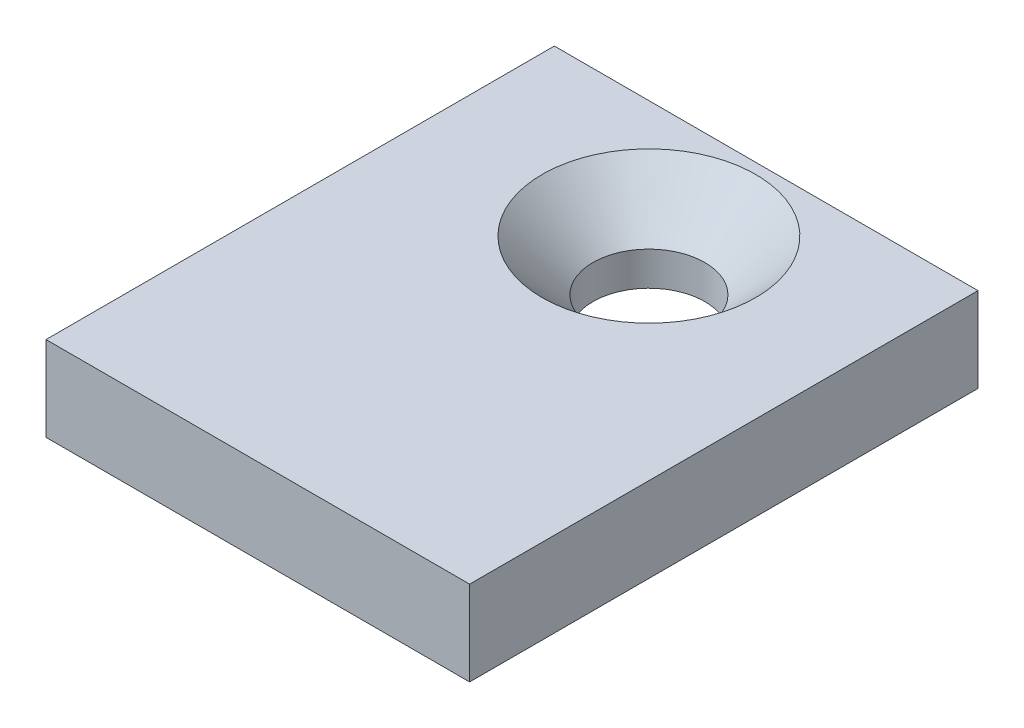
ISO-10303-21;
HEADER;
FILE_DESCRIPTION(('STEP AP214'),'2;1');
FILE_NAME('part.step','',(''),(''),'','','');
FILE_SCHEMA(('AUTOMOTIVE_DESIGN { 1 0 10303 214 1 1 1 1 }'));
ENDSEC;
DATA;
#1=APPLICATION_CONTEXT('core data for automotive mechanical design processes');
#2=APPLICATION_PROTOCOL_DEFINITION('international standard','automotive_design',2000,#1);
#3=PRODUCT_CONTEXT('',#1,'mechanical');
#4=PRODUCT('Part','Part','',(#3));
#5=PRODUCT_RELATED_PRODUCT_CATEGORY('part','',(#4));
#6=PRODUCT_DEFINITION_FORMATION('','',#4);
#7=PRODUCT_DEFINITION_CONTEXT('part definition',#1,'design');
#8=PRODUCT_DEFINITION('design','',#6,#7);
#9=PRODUCT_DEFINITION_SHAPE('','',#8);
#10=(LENGTH_UNIT() NAMED_UNIT(*) SI_UNIT(.MILLI.,.METRE.));
#11=(NAMED_UNIT(*) PLANE_ANGLE_UNIT() SI_UNIT($,.RADIAN.));
#12=(NAMED_UNIT(*) SI_UNIT($,.STERADIAN.) SOLID_ANGLE_UNIT());
#13=UNCERTAINTY_MEASURE_WITH_UNIT(LENGTH_MEASURE(1.E-05),#10,'distance_accuracy_value','');
#14=(GEOMETRIC_REPRESENTATION_CONTEXT(3) GLOBAL_UNCERTAINTY_ASSIGNED_CONTEXT((#13)) GLOBAL_UNIT_ASSIGNED_CONTEXT((#10,
#11,#12)) REPRESENTATION_CONTEXT('',''));
#15=CARTESIAN_POINT('',(0.,0.,0.));
#16=DIRECTION('',(0.,0.,1.));
#17=DIRECTION('',(1.,0.,0.));
#18=AXIS2_PLACEMENT_3D('',#15,#16,#17);
#19=CARTESIAN_POINT('',(5.20806371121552,4.80713746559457,30.));
#20=DIRECTION('',(1.,0.,0.));
#21=DIRECTION('',(0.,0.,-1.));
#22=AXIS2_PLACEMENT_3D('',#19,#20,#21);
#23=PLANE('',#22);
#24=DIRECTION('',(0.,-1.,0.));
#25=VECTOR('',#24,1.);
#26=CARTESIAN_POINT('',(5.20806371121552,4.80713746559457,0.));
#27=LINE('',#26,#25);
#28=CARTESIAN_POINT('',(5.20806371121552,4.80713746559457,0.));
#29=VERTEX_POINT('',#28);
#30=CARTESIAN_POINT('',(5.20806371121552,-0.192862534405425,0.));
#31=VERTEX_POINT('',#30);
#32=EDGE_CURVE('E104',#29,#31,#27,.T.);
#33=ORIENTED_EDGE('',*,*,#32,.T.);
#34=DIRECTION('',(0.,0.,-1.));
#35=VECTOR('',#34,1.);
#36=CARTESIAN_POINT('',(5.20806371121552,-0.192862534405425,30.));
#37=LINE('',#36,#35);
#38=CARTESIAN_POINT('',(5.20806371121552,-0.192862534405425,30.));
#39=VERTEX_POINT('',#38);
#40=EDGE_CURVE('E11',#39,#31,#37,.T.);
#41=ORIENTED_EDGE('',*,*,#40,.F.);
#42=DIRECTION('',(0.,-1.,0.));
#43=VECTOR('',#42,1.);
#44=CARTESIAN_POINT('',(5.20806371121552,4.80713746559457,30.));
#45=LINE('',#44,#43);
#46=CARTESIAN_POINT('',(5.20806371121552,4.80713746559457,30.));
#47=VERTEX_POINT('',#46);
#48=EDGE_CURVE('E92',#47,#39,#45,.T.);
#49=ORIENTED_EDGE('',*,*,#48,.F.);
#50=DIRECTION('',(0.,0.,-1.));
#51=VECTOR('',#50,1.);
#52=CARTESIAN_POINT('',(5.20806371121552,4.80713746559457,30.));
#53=LINE('',#52,#51);
#54=EDGE_CURVE('E100',#47,#29,#53,.T.);
#55=ORIENTED_EDGE('',*,*,#54,.T.);
#56=EDGE_LOOP('',(#33,#41,#49,#55));
#57=FACE_BOUND('',#56,.T.);
#58=ADVANCED_FACE('F41',(#57),#23,.F.);
#59=CARTESIAN_POINT('',(5.20806371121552,-0.192862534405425,30.));
#60=DIRECTION('',(0.,1.,0.));
#61=DIRECTION('',(0.,0.,1.));
#62=AXIS2_PLACEMENT_3D('',#59,#60,#61);
#63=PLANE('',#62);
#64=CARTESIAN_POINT('',(17.7080637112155,-0.192862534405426,6.92026996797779));
#65=DIRECTION('',(0.,1.,0.));
#66=DIRECTION('',(0.,0.,1.));
#67=AXIS2_PLACEMENT_3D('',#64,#65,#66);
#68=CIRCLE('',#67,3.3);
#69=CARTESIAN_POINT('',(17.7080637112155,-0.192862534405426,10.2202699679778));
#70=VERTEX_POINT('',#69);
#71=EDGE_CURVE('E107',#70,#70,#68,.T.);
#72=ORIENTED_EDGE('',*,*,#71,.T.);
#73=EDGE_LOOP('',(#72));
#74=FACE_BOUND('',#73,.T.);
#75=DIRECTION('',(1.,0.,0.));
#76=VECTOR('',#75,1.);
#77=CARTESIAN_POINT('',(5.20806371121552,-0.192862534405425,0.));
#78=LINE('',#77,#76);
#79=CARTESIAN_POINT('',(30.2080637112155,-0.192862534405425,0.));
#80=VERTEX_POINT('',#79);
#81=EDGE_CURVE('E96',#31,#80,#78,.T.);
#82=ORIENTED_EDGE('',*,*,#81,.T.);
#83=DIRECTION('',(0.,0.,-1.));
#84=VECTOR('',#83,1.);
#85=CARTESIAN_POINT('',(30.2080637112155,-0.192862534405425,30.));
#86=LINE('',#85,#84);
#87=CARTESIAN_POINT('',(30.2080637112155,-0.192862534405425,30.));
#88=VERTEX_POINT('',#87);
#89=EDGE_CURVE('E49',#88,#80,#86,.T.);
#90=ORIENTED_EDGE('',*,*,#89,.F.);
#91=DIRECTION('',(1.,0.,0.));
#92=VECTOR('',#91,1.);
#93=CARTESIAN_POINT('',(5.20806371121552,-0.192862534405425,30.));
#94=LINE('',#93,#92);
#95=EDGE_CURVE('E87',#39,#88,#94,.T.);
#96=ORIENTED_EDGE('',*,*,#95,.F.);
#97=ORIENTED_EDGE('',*,*,#40,.T.);
#98=EDGE_LOOP('',(#82,#90,#96,#97));
#99=FACE_BOUND('',#98,.T.);
#100=ADVANCED_FACE('F95',(#74,#99),#63,.F.);
#101=CARTESIAN_POINT('',(30.2080637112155,-0.192862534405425,30.));
#102=DIRECTION('',(-1.,0.,0.));
#103=DIRECTION('',(0.,0.,1.));
#104=AXIS2_PLACEMENT_3D('',#101,#102,#103);
#105=PLANE('',#104);
#106=DIRECTION('',(0.,1.,0.));
#107=VECTOR('',#106,1.);
#108=CARTESIAN_POINT('',(30.2080637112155,-0.192862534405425,0.));
#109=LINE('',#108,#107);
#110=CARTESIAN_POINT('',(30.2080637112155,4.80713746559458,0.));
#111=VERTEX_POINT('',#110);
#112=EDGE_CURVE('E74',#80,#111,#109,.T.);
#113=ORIENTED_EDGE('',*,*,#112,.T.);
#114=DIRECTION('',(0.,0.,-1.));
#115=VECTOR('',#114,1.);
#116=CARTESIAN_POINT('',(30.2080637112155,4.80713746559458,30.));
#117=LINE('',#116,#115);
#118=CARTESIAN_POINT('',(30.2080637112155,4.80713746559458,30.));
#119=VERTEX_POINT('',#118);
#120=EDGE_CURVE('E97',#119,#111,#117,.T.);
#121=ORIENTED_EDGE('',*,*,#120,.F.);
#122=DIRECTION('',(0.,1.,0.));
#123=VECTOR('',#122,1.);
#124=CARTESIAN_POINT('',(30.2080637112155,-0.192862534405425,30.));
#125=LINE('',#124,#123);
#126=EDGE_CURVE('E90',#88,#119,#125,.T.);
#127=ORIENTED_EDGE('',*,*,#126,.F.);
#128=ORIENTED_EDGE('',*,*,#89,.T.);
#129=EDGE_LOOP('',(#113,#121,#127,#128));
#130=FACE_BOUND('',#129,.T.);
#131=ADVANCED_FACE('F98',(#130),#105,.F.);
#132=CARTESIAN_POINT('',(30.2080637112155,4.80713746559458,30.));
#133=DIRECTION('',(0.,-1.,0.));
#134=DIRECTION('',(1.,0.,0.));
#135=AXIS2_PLACEMENT_3D('',#132,#133,#134);
#136=PLANE('',#135);
#137=CARTESIAN_POINT('',(17.7080637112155,4.80713746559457,6.92026996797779));
#138=DIRECTION('',(0.,1.,0.));
#139=DIRECTION('',(0.,0.,1.));
#140=AXIS2_PLACEMENT_3D('',#137,#138,#139);
#141=CIRCLE('',#140,6.3);
#142=CARTESIAN_POINT('',(17.7080637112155,4.80713746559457,13.2202699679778));
#143=VERTEX_POINT('',#142);
#144=EDGE_CURVE('E123',#143,#143,#141,.T.);
#145=ORIENTED_EDGE('',*,*,#144,.F.);
#146=EDGE_LOOP('',(#145));
#147=FACE_BOUND('',#146,.T.);
#148=DIRECTION('',(-1.,0.,0.));
#149=VECTOR('',#148,1.);
#150=CARTESIAN_POINT('',(30.2080637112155,4.80713746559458,0.));
#151=LINE('',#150,#149);
#152=EDGE_CURVE('E80',#111,#29,#151,.T.);
#153=ORIENTED_EDGE('',*,*,#152,.T.);
#154=ORIENTED_EDGE('',*,*,#54,.F.);
#155=DIRECTION('',(-1.,0.,0.));
#156=VECTOR('',#155,1.);
#157=CARTESIAN_POINT('',(30.2080637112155,4.80713746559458,30.));
#158=LINE('',#157,#156);
#159=EDGE_CURVE('E57',#119,#47,#158,.T.);
#160=ORIENTED_EDGE('',*,*,#159,.F.);
#161=ORIENTED_EDGE('',*,*,#120,.T.);
#162=EDGE_LOOP('',(#153,#154,#160,#161));
#163=FACE_BOUND('',#162,.T.);
#164=ADVANCED_FACE('F112',(#147,#163),#136,.F.);
#165=CARTESIAN_POINT('',(0.,0.,30.));
#166=DIRECTION('',(0.,0.,1.));
#167=DIRECTION('',(1.,0.,0.));
#168=AXIS2_PLACEMENT_3D('',#165,#166,#167);
#169=PLANE('',#168);
#170=ORIENTED_EDGE('',*,*,#48,.T.);
#171=ORIENTED_EDGE('',*,*,#95,.T.);
#172=ORIENTED_EDGE('',*,*,#126,.T.);
#173=ORIENTED_EDGE('',*,*,#159,.T.);
#174=EDGE_LOOP('',(#170,#171,#172,#173));
#175=FACE_BOUND('',#174,.T.);
#176=ADVANCED_FACE('F88',(#175),#169,.T.);
#177=CARTESIAN_POINT('',(0.,0.,0.));
#178=DIRECTION('',(0.,0.,1.));
#179=DIRECTION('',(1.,0.,0.));
#180=AXIS2_PLACEMENT_3D('',#177,#178,#179);
#181=PLANE('',#180);
#182=ORIENTED_EDGE('',*,*,#32,.F.);
#183=ORIENTED_EDGE('',*,*,#152,.F.);
#184=ORIENTED_EDGE('',*,*,#112,.F.);
#185=ORIENTED_EDGE('',*,*,#81,.F.);
#186=EDGE_LOOP('',(#182,#183,#184,#185));
#187=FACE_BOUND('',#186,.T.);
#188=ADVANCED_FACE('F115',(#187),#181,.F.);
#189=CARTESIAN_POINT('',(17.7080637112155,4.80713746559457,6.92026996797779));
#190=DIRECTION('',(0.,1.,0.));
#191=DIRECTION('',(0.,0.,1.));
#192=AXIS2_PLACEMENT_3D('',#189,#190,#191);
#193=CYLINDRICAL_SURFACE('',#192,3.3);
#194=ORIENTED_EDGE('',*,*,#71,.F.);
#195=EDGE_LOOP('',(#194));
#196=FACE_BOUND('',#195,.T.);
#197=CARTESIAN_POINT('',(17.7080637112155,1.80713746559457,6.92026996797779));
#198=DIRECTION('',(0.,1.,0.));
#199=DIRECTION('',(0.,0.,1.));
#200=AXIS2_PLACEMENT_3D('',#197,#198,#199);
#201=CIRCLE('',#200,3.3);
#202=CARTESIAN_POINT('',(17.7080637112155,1.80713746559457,10.2202699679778));
#203=VERTEX_POINT('',#202);
#204=EDGE_CURVE('E120',#203,#203,#201,.T.);
#205=ORIENTED_EDGE('',*,*,#204,.T.);
#206=EDGE_LOOP('',(#205));
#207=FACE_BOUND('',#206,.T.);
#208=ADVANCED_FACE('F147',(#196,#207),#193,.F.);
#209=CARTESIAN_POINT('',(17.7080637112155,4.80713746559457,6.92026996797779));
#210=DIRECTION('',(0.,1.,0.));
#211=DIRECTION('',(0.,0.,1.));
#212=AXIS2_PLACEMENT_3D('',#209,#210,#211);
#213=CONICAL_SURFACE('',#212,6.3,0.785398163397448);
#214=ORIENTED_EDGE('',*,*,#204,.F.);
#215=EDGE_LOOP('',(#214));
#216=FACE_BOUND('',#215,.T.);
#217=ORIENTED_EDGE('',*,*,#144,.T.);
#218=EDGE_LOOP('',(#217));
#219=FACE_BOUND('',#218,.T.);
#220=ADVANCED_FACE('F127',(#216,#219),#213,.F.);
#221=CLOSED_SHELL('',(#58,#100,#131,#164,#176,#188,#208,#220));
#222=MANIFOLD_SOLID_BREP('B2',#221);
#223=ADVANCED_BREP_SHAPE_REPRESENTATION('',(#18,#222),#14);
#224=SHAPE_DEFINITION_REPRESENTATION(#9,#223);
ENDSEC;
END-ISO-10303-21;
